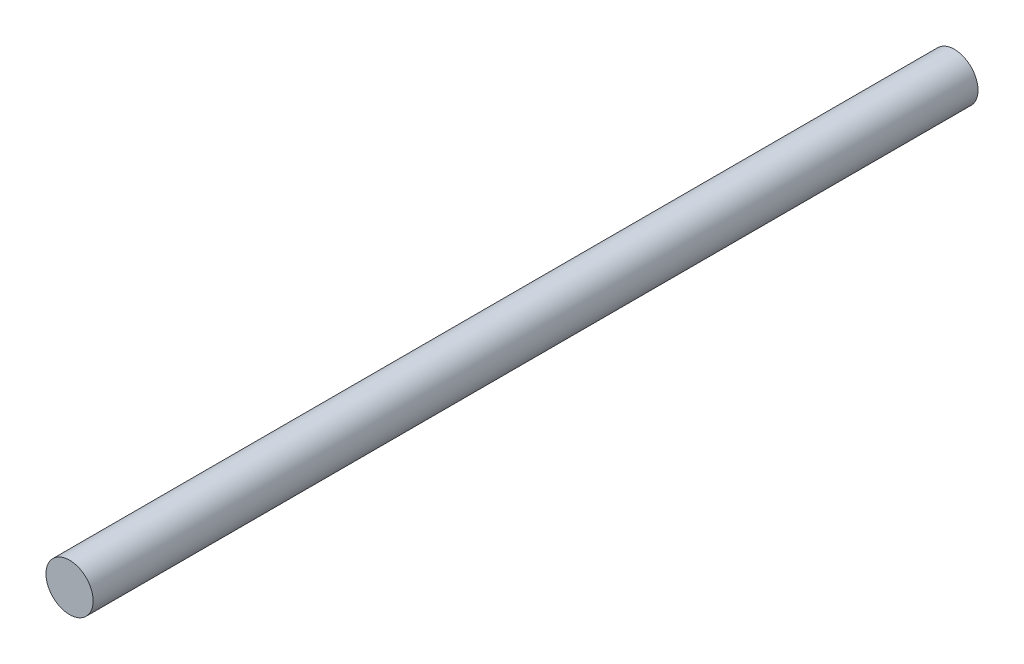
ISO-10303-21;
HEADER;
FILE_DESCRIPTION(('STEP AP214'),'2;1');
FILE_NAME('part.step','',(''),(''),'','','');
FILE_SCHEMA(('AUTOMOTIVE_DESIGN { 1 0 10303 214 1 1 1 1 }'));
ENDSEC;
DATA;
#1=APPLICATION_CONTEXT('core data for automotive mechanical design processes');
#2=APPLICATION_PROTOCOL_DEFINITION('international standard','automotive_design',2000,#1);
#3=PRODUCT_CONTEXT('',#1,'mechanical');
#4=PRODUCT('Part','Part','',(#3));
#5=PRODUCT_RELATED_PRODUCT_CATEGORY('part','',(#4));
#6=PRODUCT_DEFINITION_FORMATION('','',#4);
#7=PRODUCT_DEFINITION_CONTEXT('part definition',#1,'design');
#8=PRODUCT_DEFINITION('design','',#6,#7);
#9=PRODUCT_DEFINITION_SHAPE('','',#8);
#10=(LENGTH_UNIT() NAMED_UNIT(*) SI_UNIT(.MILLI.,.METRE.));
#11=(NAMED_UNIT(*) PLANE_ANGLE_UNIT() SI_UNIT($,.RADIAN.));
#12=(NAMED_UNIT(*) SI_UNIT($,.STERADIAN.) SOLID_ANGLE_UNIT());
#13=UNCERTAINTY_MEASURE_WITH_UNIT(LENGTH_MEASURE(1.E-05),#10,'distance_accuracy_value','');
#14=(GEOMETRIC_REPRESENTATION_CONTEXT(3) GLOBAL_UNCERTAINTY_ASSIGNED_CONTEXT((#13)) GLOBAL_UNIT_ASSIGNED_CONTEXT((#10,
#11,#12)) REPRESENTATION_CONTEXT('',''));
#15=CARTESIAN_POINT('',(0.,0.,0.));
#16=DIRECTION('',(0.,0.,1.));
#17=DIRECTION('',(1.,0.,0.));
#18=AXIS2_PLACEMENT_3D('',#15,#16,#17);
#19=CARTESIAN_POINT('',(0.,0.,150.));
#20=DIRECTION('',(0.,0.,-1.));
#21=DIRECTION('',(-1.,0.,0.));
#22=AXIS2_PLACEMENT_3D('',#19,#20,#21);
#23=CYLINDRICAL_SURFACE('',#22,4.);
#24=CARTESIAN_POINT('',(0.,0.,150.));
#25=DIRECTION('',(0.,0.,1.));
#26=DIRECTION('',(1.,0.,0.));
#27=AXIS2_PLACEMENT_3D('',#24,#25,#26);
#28=CIRCLE('',#27,4.);
#29=CARTESIAN_POINT('',(4.,0.,150.));
#30=VERTEX_POINT('',#29);
#31=EDGE_CURVE('E10',#30,#30,#28,.T.);
#32=ORIENTED_EDGE('',*,*,#31,.F.);
#33=EDGE_LOOP('',(#32));
#34=FACE_BOUND('',#33,.T.);
#35=CARTESIAN_POINT('',(0.,0.,0.));
#36=DIRECTION('',(0.,0.,1.));
#37=DIRECTION('',(1.,0.,0.));
#38=AXIS2_PLACEMENT_3D('',#35,#36,#37);
#39=CIRCLE('',#38,4.);
#40=CARTESIAN_POINT('',(4.,0.,0.));
#41=VERTEX_POINT('',#40);
#42=EDGE_CURVE('E32',#41,#41,#39,.T.);
#43=ORIENTED_EDGE('',*,*,#42,.T.);
#44=EDGE_LOOP('',(#43));
#45=FACE_BOUND('',#44,.T.);
#46=ADVANCED_FACE('F26',(#34,#45),#23,.T.);
#47=CARTESIAN_POINT('',(0.,0.,150.));
#48=DIRECTION('',(0.,0.,1.));
#49=DIRECTION('',(1.,0.,0.));
#50=AXIS2_PLACEMENT_3D('',#47,#48,#49);
#51=PLANE('',#50);
#52=ORIENTED_EDGE('',*,*,#31,.T.);
#53=EDGE_LOOP('',(#52));
#54=FACE_BOUND('',#53,.T.);
#55=ADVANCED_FACE('F41',(#54),#51,.T.);
#56=CARTESIAN_POINT('',(0.,0.,0.));
#57=DIRECTION('',(0.,0.,1.));
#58=DIRECTION('',(1.,0.,0.));
#59=AXIS2_PLACEMENT_3D('',#56,#57,#58);
#60=PLANE('',#59);
#61=ORIENTED_EDGE('',*,*,#42,.F.);
#62=EDGE_LOOP('',(#61));
#63=FACE_BOUND('',#62,.T.);
#64=ADVANCED_FACE('F39',(#63),#60,.F.);
#65=CLOSED_SHELL('',(#46,#55,#64));
#66=MANIFOLD_SOLID_BREP('B2',#65);
#67=ADVANCED_BREP_SHAPE_REPRESENTATION('',(#18,#66),#14);
#68=SHAPE_DEFINITION_REPRESENTATION(#9,#67);
ENDSEC;
END-ISO-10303-21;
